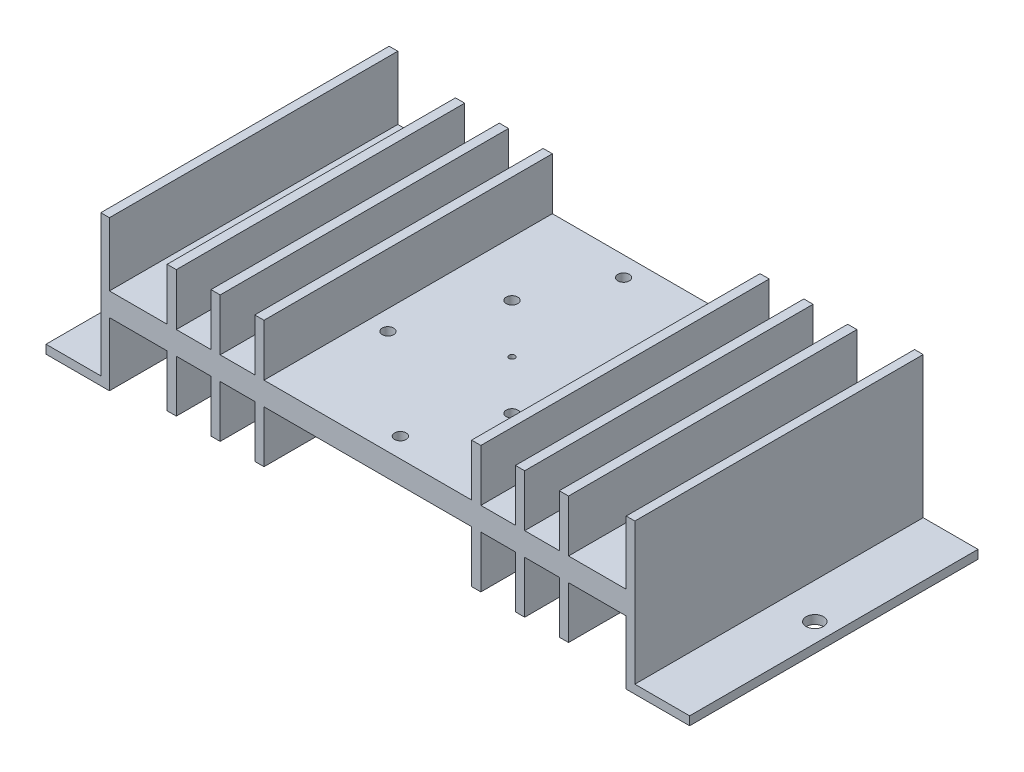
from build123d import *

# Parameters (mm, degrees)
BOSS_EXTRU_1_DEPTH      = 50
ESQUISSE3_R             = 1.5
ENL_V_MAT_EXTRU_1_DEPTH = 10
ESQUISSE4_R             = 1
ESQUISSE4_R_2           = 0.5
ENL_V_MAT_EXTRU_2_DEPTH = 4


with BuildPart() as part:
    # Esquisse1 → Boss.-Extru.1 (new body)
    with BuildSketch(Plane.XY):
        Polygon((-52.382563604, -2), (-41.382563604, -2), (-41.382563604, 9), (-31.382563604, 9), (-31.382563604, 0), (-29.782563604, 0), (-29.782563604, 9), (-23.782563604, 9), (-23.782563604, 0), (-22.182563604, 0), (-22.182563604, 9), (-16.182563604, 9), (-16.182563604, 0), (-14.582563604, 0), (-14.582563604, 9), (21.417436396, 9), (21.417436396, 0), (23.017436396, 0), (23.017436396, 9), (29.017436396, 9), (29.017436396, 0), (30.617436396, 0), (30.617436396, 9), (36.617436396, 9), (36.617436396, 0), (38.217436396, 0), (38.217436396, 9), (48.217436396, 9), (48.217436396, -2), (59.217436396, -2), (59.217436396, -0.5), (49.717436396, -0.5), (49.717436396, 24), (48.217436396, 24), (48.217436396, 13), (38.217436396, 13), (38.217436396, 22), (36.617436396, 22), (36.617436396, 13), (30.617436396, 13), (30.617436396, 22), (29.017436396, 22), (29.017436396, 13), (23.017436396, 13), (23.017436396, 22), (21.417436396, 22), (21.417436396, 13), (-14.582563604, 13), (-14.582563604, 22), (-16.182563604, 22), (-16.182563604, 13), (-22.182563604, 13), (-22.182563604, 22), (-23.782563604, 22), (-23.782563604, 13), (-29.782563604, 13), (-29.782563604, 22), (-31.382563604, 22), (-31.382563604, 13), (-41.382563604, 13), (-41.382563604, 24), (-42.882563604, 24), (-42.882563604, -0.5), (-52.382563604, -0.5), align=None)
    extrude(amount=BOSS_EXTRU_1_DEPTH)

    # Esquisse3 → Enl_v. mat.-Extru.1 (cut)
    with BuildSketch(Plane(origin=(0, -0.5, 0), x_dir=(1, 0, 0), z_dir=(0, 1, 0))):
        with Locations(Location((-49.082563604, -25, 0), (0, 0, 180))):
            Circle(ESQUISSE3_R)
        with Locations(Location((55.917436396, -25, 0), (0, 0, 180))):
            Circle(ESQUISSE3_R)
    extrude(amount=-ENL_V_MAT_EXTRU_1_DEPTH, mode=Mode.SUBTRACT)

    # Esquisse4 → Enl_v. mat.-Extru.2 (cut)
    with BuildSketch(Plane(origin=(0, 13, 0), x_dir=(1, 0, 0), z_dir=(0, 1, 0))):
        with Locations(Location((5.647436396, -46.59, 0), (0, 0, 180))):
            Circle(ESQUISSE4_R)
        with Locations(Location((-11.172563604, -31.925, 0), (0, 0, 180))):
            Circle(ESQUISSE4_R)
        with Locations(Location((18.007436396, -18.09, 0), (0, 0, 180))):
            Circle(ESQUISSE4_R)
        with Locations(Location((1.187436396, -3.425, 0), (0, 0, 180))):
            Circle(ESQUISSE4_R)
        with Locations(Location((3.417436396, -25, 0), (0, 0, 180))):
            Circle(ESQUISSE4_R_2)
        with Locations(Location((-5.067844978, -16.514718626, 0), (0, 0, 180))):
            Circle(ESQUISSE4_R)
        with Locations((11.90271777, -33.485281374)):
            Circle(ESQUISSE4_R)
    extrude(amount=-ENL_V_MAT_EXTRU_2_DEPTH, mode=Mode.SUBTRACT)


solid = part.part
